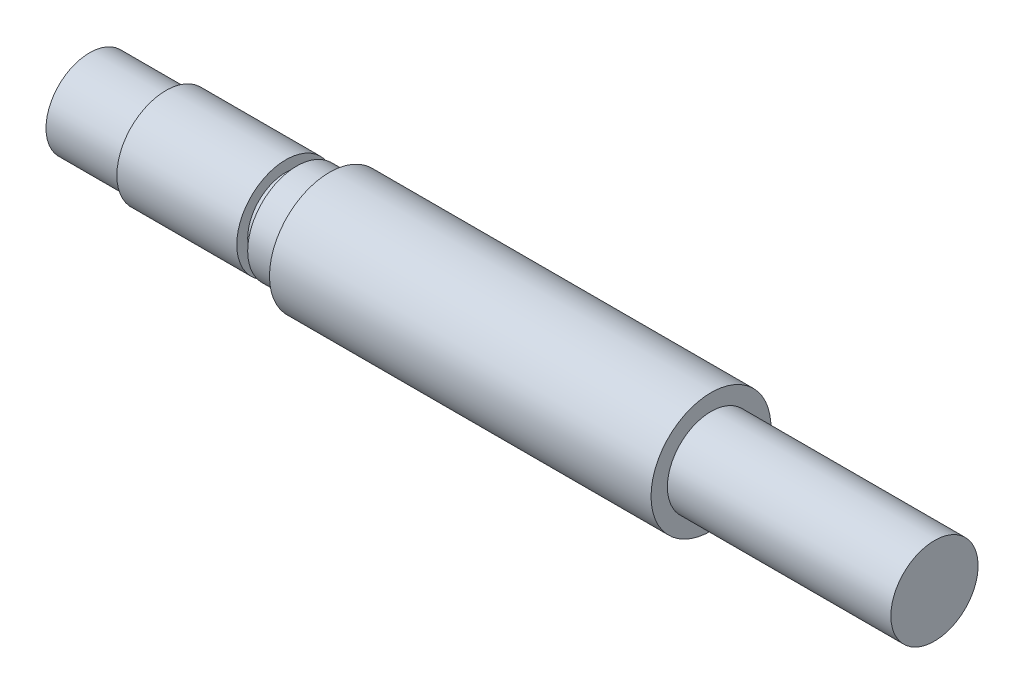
from build123d import *


with BuildPart() as part:
    # Esquisse1 → R_volution1 (revolve)
    with BuildSketch(Plane.XY, mode=Mode.PRIVATE) as r_volution1_sk:
        Polygon((0, 0), (0, 4), (7, 4), (7, 4.5), (18, 4.5), (18, 3.5), (19, 3.5), (19, 4.5), (22, 4.5), (22, 5.5), (57, 5.5), (57, 4), (77.5, 4), (77.5, 0), align=None)
    revolve(r_volution1_sk.sketch.rotate(Axis((0, 0, 0), (1, 0, 0)), 90), axis=Axis((0, 0, 0), (1, 0, 0)))


solid = part.part
